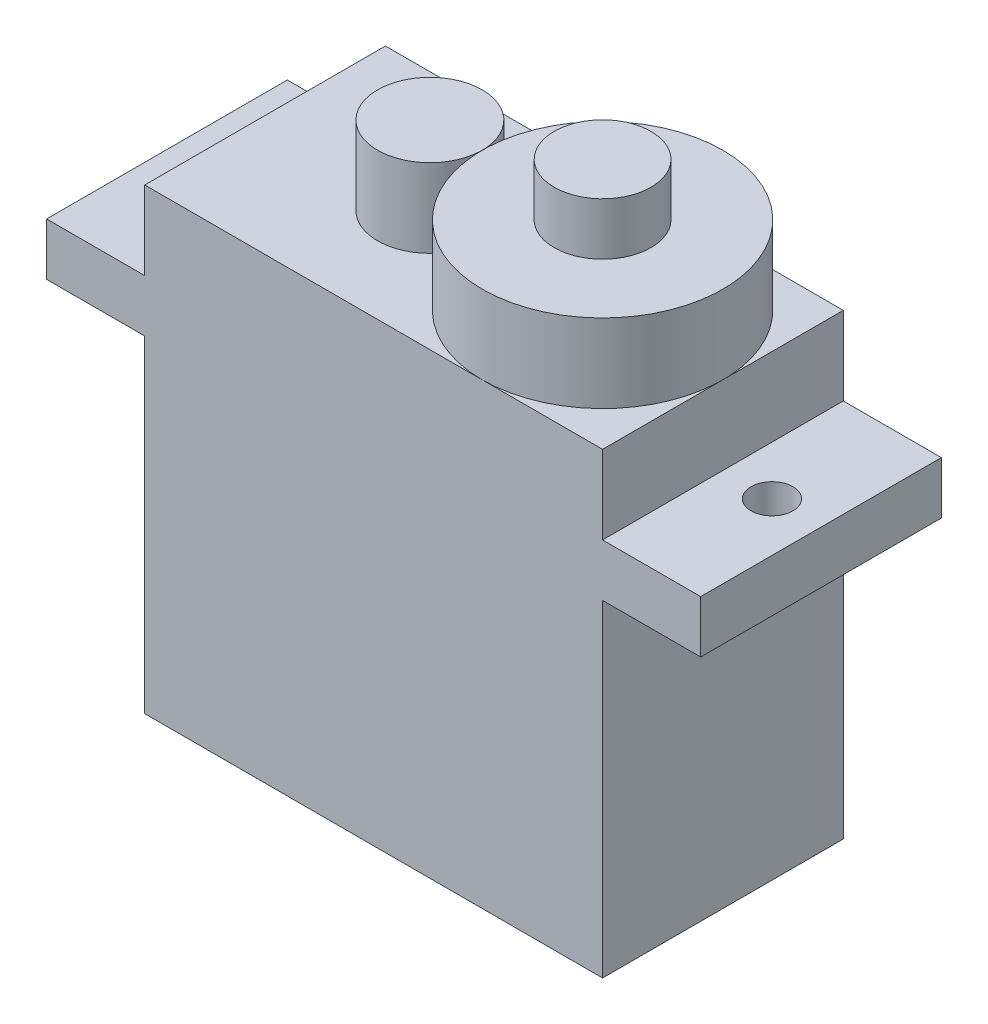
from build123d import *

# Parameters (mm, degrees)
SKETCH1_W            = 31.75
SKETCH1_H            = 11.684
BOSS_EXTRUDE1_DEPTH  = 2.54
SKETCH2_W            = 22.225
SKETCH2_H            = 11.684
BOSS_EXTRUDE2_DEPTH  = 3.81
SKETCH3_R            = 2.54
BOSS_EXTRUDE7_DEPTH  = 3.81
SKETCH4_R            = 5.842
BOSS_EXTRUDE9_DEPTH  = 3.81
SKETCH5_R            = 2.3495
BOSS_EXTRUDE10_DEPTH = 2.54
SKETCH6_W            = 22.225
SKETCH6_H            = 11.684
BOSS_EXTRUDE11_DEPTH = 15.875
SKETCH7_R            = 1.016
CUT_EXTRUDE1_DEPTH   = 39.518704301


with BuildPart() as part:
    # Sketch1 → Boss-Extrude1 (new body)
    with BuildSketch(Plane(origin=(0, 0, 0), x_dir=(1, 0, 0), z_dir=(0, 1, 0))):
        with Locations((15.875, 5.842)):
            Rectangle(SKETCH1_W, SKETCH1_H)
    extrude(amount=BOSS_EXTRUDE1_DEPTH)

    # Sketch2 → Boss-Extrude2 (add)
    with BuildSketch(Plane(origin=(0, 2.54, 0), x_dir=(1, 0, 0), z_dir=(0, 1, 0))):
        with Locations((15.875, 5.842)):
            Rectangle(SKETCH2_W, SKETCH2_H)
    extrude(amount=BOSS_EXTRUDE2_DEPTH)

    # Sketch3 → Boss-Extrude7 (add)
    with BuildSketch(Plane(origin=(0, 6.35, 0), x_dir=(1, 0, 0), z_dir=(0, 1, 0))):
        with Locations(Location((12.7635, 5.842, 0), (0, 0, 90))):
            Circle(SKETCH3_R)
    extrude(amount=BOSS_EXTRUDE7_DEPTH)

    # Sketch6 → Boss-Extrude11 (add)
    with BuildSketch(Plane.XZ):
        with Locations((15.875, -5.842)):
            Rectangle(SKETCH6_W, SKETCH6_H)
    extrude(amount=BOSS_EXTRUDE11_DEPTH)

    # Sketch7 → Cut-Extrude1 (cut, through all)
    with BuildSketch(Plane(origin=(0, 2.54, 0), x_dir=(1, 0, 0), z_dir=(0, 1, 0))):
        with Locations(Location((2.38125, 5.842, 0), (0, 0, 270))):
            Circle(SKETCH7_R)
        with Locations(Location((29.36875, 5.842, 0), (0, 0, 90))):
            Circle(SKETCH7_R)
    extrude(amount=-CUT_EXTRUDE1_DEPTH, mode=Mode.SUBTRACT)


with BuildPart() as body_2:
    # Sketch4 → Boss-Extrude9 (new body)
    with BuildSketch(Plane(origin=(0, 6.35, 0), x_dir=(1, 0, 0), z_dir=(0, 1, 0))):
        with Locations(Location((21.1455, 5.842, 0), (0, 0, 90))):
            Circle(SKETCH4_R)
    extrude(amount=BOSS_EXTRUDE9_DEPTH)

    # Sketch5 → Boss-Extrude10 (add)
    with BuildSketch(Plane(origin=(0, 10.16, 0), x_dir=(1, 0, 0), z_dir=(0, 1, 0))):
        with Locations(Location((21.1455, 5.842, 0), (0, 0, 270))):
            Circle(SKETCH5_R)
    extrude(amount=BOSS_EXTRUDE10_DEPTH)


solid = Compound([part.part, body_2.part])
